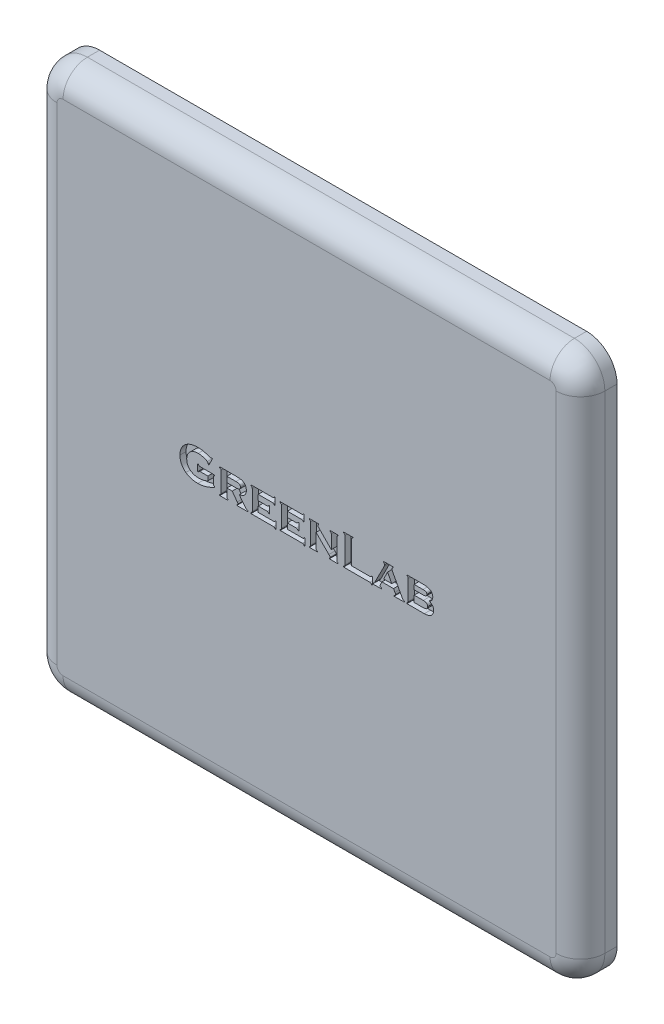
from build123d import *

# Parameters (mm, degrees)
SKETCH1_W           = 45
SKETCH1_H           = 45
BOSS_EXTRUDE1_DEPTH = 3
FILLET1_R           = 2.5
FILLET2_R           = 2
CUT_EXTRUDE1_DEPTH  = 0.5


with BuildPart() as part:
    # Sketch1 → Boss-Extrude1 (new body)
    with BuildSketch(Plane.XY.offset(3)):
        Rectangle(SKETCH1_W, SKETCH1_H)
    extrude(amount=-BOSS_EXTRUDE1_DEPTH)

    # Fillet1
    fillet1_edges = [part.edges().sort_by_distance(p)[0] for p in [
        (-22.5, -22.5, 1.5),
        (-22.5, 22.5, 1.5),
        (22.5, 22.5, 1.5),
        (22.5, -22.5, 1.5),
    ]]
    fillet(fillet1_edges, radius=FILLET1_R)

    # Fillet2
    fillet2_edges = [part.edges().sort_by_distance(p)[0] for p in [
        (0, 22.5, 3),
        (0, -22.5, 3),
        (22.5, 0, 3),
        (-22.5, 0, 3),
        (21.767766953, -21.767766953, 3),
        (-21.767766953, -21.767766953, 3),
        (21.767766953, 21.767766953, 3),
        (-21.767766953, 21.767766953, 3),
    ]]
    fillet(fillet2_edges, radius=FILLET2_R)

    # Sketch2 → Cut-Extrude1 (cut)
    # profile 1 of 8: a face of its own
    with BuildSketch(Plane.XY.offset(3)):
        with BuildLine():
            Line((-8.107638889, -0.347222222), (-8.736979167, -0.347222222))
            add(Edge.make_bspline(
                [(-8.736979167, -0.347222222), (-8.746019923, -0.347634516), (-8.763102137, -0.34841353), (-8.787347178, -0.35149615), (-8.807491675, -0.359463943), (-8.824959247, -0.369292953), (-8.838890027, -0.38393915), (-8.851469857, -0.402230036), (-8.862777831, -0.425071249), (-8.86849343, -0.442262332), (-8.871527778, -0.451388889)],
                knots=[0, 0, 0, 0, 1.161951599, 2.195469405, 3.113157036, 3.92473158, 4.744880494, 5.677977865, 6.767264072, 8, 8, 8, 8], degree=3))
            Line((-8.871527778, -0.451388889), (-8.940972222, -0.451388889))
            Line((-8.940972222, -0.451388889), (-8.940972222, 0.104166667))
            Line((-8.940972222, 0.104166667), (-8.871527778, 0.104166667))
            add(Edge.make_bspline(
                [(-8.871527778, 0.104166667), (-8.868544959, 0.094831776), (-8.86297233, 0.077391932), (-8.851170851, 0.054602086), (-8.83964868, 0.03555398), (-8.825666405, 0.021148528), (-8.808569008, 0.011661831), (-8.788872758, 0.00441836), (-8.765290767, 0.001141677), (-8.74855745, 0.000395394), (-8.73969184, 0)],
                knots=[0, 0, 0, 0, 1.267174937, 2.367390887, 3.316236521, 4.144614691, 4.932227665, 5.829021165, 6.8497767, 8, 8, 8, 8], degree=3))
            Line((-8.73969184, 0), (-7.552083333, 0))
            Line((-7.552083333, 0), (-7.552083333, -0.069444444))
            add(Edge.make_bspline(
                [(-7.552083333, -0.069444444), (-7.561041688, -0.072276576), (-7.577879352, -0.077599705), (-7.600257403, -0.088767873), (-7.618962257, -0.100221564), (-7.633298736, -0.113946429), (-7.644193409, -0.129700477), (-7.650911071, -0.14859326), (-7.655417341, -0.170325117), (-7.655959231, -0.185880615), (-7.65625, -0.194227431)],
                knots=[0, 0, 0, 0, 1.261989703, 2.371971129, 3.357346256, 4.200586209, 5.023932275, 5.909634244, 6.878345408, 8, 8, 8, 8], degree=3))
            Line((-7.65625, -0.194227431), (-7.65625, -0.673828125))
            add(Edge.make_bspline(
                [(-7.65625, -0.673828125), (-7.655889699, -0.682161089), (-7.655219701, -0.697656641), (-7.651544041, -0.719691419), (-7.644732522, -0.738581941), (-7.634437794, -0.754788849), (-7.620144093, -0.76839035), (-7.601054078, -0.779314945), (-7.578418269, -0.790471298), (-7.561224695, -0.795785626), (-7.552083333, -0.798611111)],
                knots=[0, 0, 0, 0, 1.116533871, 2.076248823, 2.980572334, 3.786808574, 4.626198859, 5.59413096, 6.720864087, 8, 8, 8, 8], degree=3))
            Line((-7.552083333, -0.798611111), (-7.552083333, -0.868055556))
            add(Edge.make_bspline(
                [(-7.552083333, -0.868055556), (-7.610666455, -0.901306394), (-7.725820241, -0.966665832), (-7.902088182, -1.051148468), (-8.0768336, -1.123083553), (-8.250217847, -1.181933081), (-8.422179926, -1.22792273), (-8.592791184, -1.26040836), (-8.762157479, -1.280912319), (-8.874726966, -1.283457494), (-8.930664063, -1.284722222)],
                knots=[0, 0, 0, 0, 1.109239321, 2.180373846, 3.216973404, 4.220153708, 5.194106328, 6.146335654, 7.078892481, 8, 8, 8, 8], degree=3))
            add(Edge.make_bspline(
                [(-8.930664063, -1.284722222), (-8.980070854, -1.283992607), (-9.076548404, -1.282567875), (-9.217712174, -1.26841923), (-9.352032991, -1.246781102), (-9.479198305, -1.214926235), (-9.600077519, -1.175751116), (-9.713379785, -1.12610841), (-9.820263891, -1.068197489), (-9.885929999, -1.022231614), (-9.918619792, -0.999348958)],
                knots=[0, 0, 0, 0, 1.133031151, 2.212490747, 3.251195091, 4.25132316, 5.216867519, 6.162529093, 7.085273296, 8, 8, 8, 8], degree=3))
            add(Edge.make_bspline(
                [(-9.918619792, -0.999348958), (-9.938124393, -0.984168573), (-9.976843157, -0.954033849), (-10.031627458, -0.905928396), (-10.082161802, -0.855026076), (-10.129550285, -0.802718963), (-10.17259339, -0.747401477), (-10.211973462, -0.690094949), (-10.248171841, -0.630940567), (-10.279424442, -0.569179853), (-10.30797848, -0.505624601), (-10.332178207, -0.439559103), (-10.352729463, -0.371389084), (-10.370474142, -0.301271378), (-10.383184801, -0.228693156), (-10.392260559, -0.153891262), (-10.398679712, -0.077151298), (-10.399095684, -0.025150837), (-10.399305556, 0.001085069)],
                knots=[0, 0, 0, 0, 1.027594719, 2.039887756, 3.02889878, 4.008719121, 4.97294883, 5.940778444, 6.898978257, 7.854104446, 8.816896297, 9.794723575, 10.777166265, 11.776613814, 12.800294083, 13.838400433, 14.909403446, 16, 16, 16, 16], degree=3))
            add(Edge.make_bspline(
                [(-10.399305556, 0.001085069), (-10.398163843, 0.049624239), (-10.395933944, 0.144426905), (-10.375311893, 0.2828534), (-10.341722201, 0.41361329), (-10.295190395, 0.537141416), (-10.234124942, 0.652470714), (-10.160674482, 0.760529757), (-10.073195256, 0.860943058), (-10.005960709, 0.919974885), (-9.971788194, 0.949978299)],
                knots=[0, 0, 0, 0, 1.080618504, 2.110574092, 3.109061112, 4.08310081, 5.043468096, 6.008781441, 6.987946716, 8, 8, 8, 8], degree=3))
            add(Edge.make_bspline(
                [(-9.971788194, 0.949978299), (-9.937269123, 0.977010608), (-9.867919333, 1.031319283), (-9.752786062, 1.098570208), (-9.630135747, 1.156516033), (-9.498958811, 1.203687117), (-9.359427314, 1.239848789), (-9.211752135, 1.265688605), (-9.055798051, 1.281667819), (-8.948968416, 1.28368846), (-8.894314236, 1.284722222)],
                knots=[0, 0, 0, 0, 0.913103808, 1.834451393, 2.772129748, 3.738097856, 4.735733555, 5.773315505, 6.860825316, 8, 8, 8, 8], degree=3))
            add(Edge.make_bspline(
                [(-8.894314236, 1.284722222), (-8.859221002, 1.284112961), (-8.790049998, 1.282912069), (-8.687866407, 1.276048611), (-8.588838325, 1.263397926), (-8.491005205, 1.245834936), (-8.391504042, 1.221898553), (-8.286896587, 1.191809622), (-8.175981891, 1.154967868), (-8.100485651, 1.126398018), (-8.061523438, 1.111653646)],
                knots=[0, 0, 0, 0, 0.983904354, 1.939338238, 2.869415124, 3.781350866, 4.72455948, 5.737149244, 6.832184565, 8, 8, 8, 8], degree=3))
            add(Edge.make_bspline(
                [(-8.061523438, 1.111653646), (-8.042421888, 1.104222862), (-8.007378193, 1.090590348), (-7.958763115, 1.074748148), (-7.918882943, 1.064487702), (-7.895004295, 1.062571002), (-7.884657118, 1.061740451)],
                knots=[0, 0, 0, 0, 1.33242011, 2.444457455, 3.325947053, 4, 4, 4, 4], degree=3))
            add(Edge.make_bspline(
                [(-7.884657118, 1.061740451), (-7.87789614, 1.062329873), (-7.863399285, 1.063593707), (-7.841685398, 1.072586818), (-7.818394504, 1.085933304), (-7.803311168, 1.097688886), (-7.795138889, 1.10405816)],
                knots=[0, 0, 0, 0, 0.80452628, 1.72506123, 2.767418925, 4, 4, 4, 4], degree=3))
            Line((-7.795138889, 1.10405816), (-7.725694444, 1.076388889))
            Line((-7.725694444, 1.076388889), (-8.020833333, 0.477430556))
            Line((-8.020833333, 0.477430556), (-8.074001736, 0.505642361))
            add(Edge.make_bspline(
                [(-8.074001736, 0.505642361), (-8.074303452, 0.515250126), (-8.074858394, 0.53292155), (-8.079026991, 0.557160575), (-8.083484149, 0.577292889), (-8.090167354, 0.594498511), (-8.101350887, 0.609467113), (-8.115250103, 0.625852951), (-8.134663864, 0.64292875), (-8.149183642, 0.654545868), (-8.157009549, 0.660807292)],
                knots=[0, 0, 0, 0, 1.244331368, 2.288680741, 3.181265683, 3.916936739, 4.658188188, 5.588746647, 6.700376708, 8, 8, 8, 8], degree=3))
            add(Edge.make_bspline(
                [(-8.157009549, 0.660807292), (-8.177704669, 0.675012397), (-8.221692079, 0.705205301), (-8.298225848, 0.743529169), (-8.387995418, 0.777376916), (-8.487614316, 0.808613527), (-8.592124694, 0.834707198), (-8.696489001, 0.853755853), (-8.79800503, 0.865740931), (-8.864805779, 0.867293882), (-8.897569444, 0.868055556)],
                knots=[0, 0, 0, 0, 0.772448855, 1.64183753, 2.627606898, 3.725128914, 4.855858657, 5.942928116, 6.991070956, 8, 8, 8, 8], degree=3))
            add(Edge.make_bspline(
                [(-8.897569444, 0.868055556), (-8.929789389, 0.867506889), (-8.992775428, 0.866434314), (-9.085311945, 0.855766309), (-9.173499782, 0.838592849), (-9.257798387, 0.814661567), (-9.337574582, 0.783836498), (-9.413144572, 0.7458094), (-9.485140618, 0.701918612), (-9.528900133, 0.666554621), (-9.55078125, 0.648871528)],
                knots=[0, 0, 0, 0, 1.098368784, 2.14717621, 3.171603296, 4.15934231, 5.131674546, 6.083189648, 7.041535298, 8, 8, 8, 8], degree=3))
            add(Edge.make_bspline(
                [(-9.55078125, 0.648871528), (-9.574285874, 0.62788857), (-9.620495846, 0.58663618), (-9.679919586, 0.516055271), (-9.730560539, 0.441157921), (-9.772321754, 0.361166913), (-9.804401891, 0.276060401), (-9.82687576, 0.185921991), (-9.841700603, 0.09109294), (-9.843057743, 0.026099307), (-9.84375, -0.007052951)],
                knots=[0, 0, 0, 0, 1.016795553, 1.999014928, 2.971244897, 3.932867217, 4.907271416, 5.901990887, 6.92983762, 8, 8, 8, 8], degree=3))
            add(Edge.make_bspline(
                [(-9.84375, -0.007052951), (-9.843027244, -0.039300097), (-9.84161552, -0.102286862), (-9.827287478, -0.194381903), (-9.805662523, -0.281931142), (-9.773562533, -0.364534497), (-9.733608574, -0.442507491), (-9.683783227, -0.515299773), (-9.62613185, -0.584302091), (-9.580802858, -0.624636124), (-9.557834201, -0.645073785)],
                knots=[0, 0, 0, 0, 1.069643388, 2.089281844, 3.086639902, 4.057689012, 5.02427436, 5.988321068, 6.980662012, 8, 8, 8, 8], degree=3))
            add(Edge.make_bspline(
                [(-9.557834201, -0.645073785), (-9.535565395, -0.66289434), (-9.490831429, -0.698692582), (-9.417196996, -0.744305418), (-9.338000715, -0.782097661), (-9.254216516, -0.813760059), (-9.16521899, -0.838245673), (-9.070966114, -0.855186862), (-8.971633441, -0.866595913), (-8.903570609, -0.867562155), (-8.868815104, -0.868055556)],
                knots=[0, 0, 0, 0, 0.924808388, 1.857771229, 2.80254234, 3.768129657, 4.760342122, 5.792672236, 6.872853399, 8, 8, 8, 8], degree=3))
            add(Edge.make_bspline(
                [(-8.868815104, -0.868055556), (-8.834259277, -0.867328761), (-8.765223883, -0.865876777), (-8.661897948, -0.857261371), (-8.559468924, -0.841751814), (-8.458511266, -0.821473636), (-8.361401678, -0.795732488), (-8.269900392, -0.765568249), (-8.185549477, -0.730503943), (-8.133135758, -0.702960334), (-8.107638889, -0.689561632)],
                knots=[0, 0, 0, 0, 1.05048524, 2.098652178, 3.148964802, 4.19795309, 5.227341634, 6.200829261, 7.124785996, 8, 8, 8, 8], degree=3))
            Line((-8.107638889, -0.689561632), (-8.107638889, -0.347222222))
        make_face()
    # profile 2 of 8: a face of its own
    with BuildSketch(Plane.XY.offset(3)):
        with BuildLine():
            Line((-6.545138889, -0.416666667), (-6.545138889, -1.048177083))
            add(Edge.make_bspline(
                [(-6.545138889, -1.048177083), (-6.544839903, -1.0568801), (-6.544281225, -1.073142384), (-6.539846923, -1.095995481), (-6.532938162, -1.115684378), (-6.523033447, -1.132897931), (-6.508225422, -1.146977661), (-6.489947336, -1.159747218), (-6.467080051, -1.171315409), (-6.450096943, -1.177326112), (-6.440972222, -1.180555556)],
                knots=[0, 0, 0, 0, 1.132768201, 2.116668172, 3.018181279, 3.842213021, 4.674950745, 5.655178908, 6.740169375, 8, 8, 8, 8], degree=3))
            Line((-6.440972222, -1.180555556), (-6.440972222, -1.25))
            Line((-6.440972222, -1.25), (-7.135416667, -1.25))
            Line((-7.135416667, -1.25), (-7.135416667, -1.180555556))
            add(Edge.make_bspline(
                [(-7.135416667, -1.180555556), (-7.126472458, -1.177700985), (-7.109661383, -1.172335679), (-7.087153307, -1.161465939), (-7.068820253, -1.149034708), (-7.05447955, -1.134320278), (-7.043995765, -1.116821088), (-7.036416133, -1.09662627), (-7.032154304, -1.073126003), (-7.031564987, -1.056513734), (-7.03125, -1.047634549)],
                knots=[0, 0, 0, 0, 1.214843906, 2.283358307, 3.225537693, 4.070394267, 4.922042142, 5.848661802, 6.850119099, 8, 8, 8, 8], degree=3))
            Line((-7.03125, -1.047634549), (-7.03125, 0.59624566))
            add(Edge.make_bspline(
                [(-7.03125, 0.59624566), (-7.031680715, 0.604919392), (-7.032501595, 0.621450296), (-7.035379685, 0.64488467), (-7.04376477, 0.664293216), (-7.05327372, 0.681553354), (-7.068135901, 0.6953932), (-7.086043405, 0.708696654), (-7.109231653, 0.719741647), (-7.126318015, 0.725891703), (-7.135416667, 0.729166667)],
                knots=[0, 0, 0, 0, 1.128472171, 2.1507081, 3.035212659, 3.856119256, 4.685698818, 5.643135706, 6.74494729, 8, 8, 8, 8], degree=3))
            Line((-7.135416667, 0.729166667), (-7.135416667, 0.798611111))
            Line((-7.135416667, 0.798611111), (-5.805121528, 0.798611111))
            add(Edge.make_bspline(
                [(-5.805121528, 0.798611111), (-5.764428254, 0.798319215), (-5.688252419, 0.797772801), (-5.581604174, 0.793316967), (-5.490562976, 0.784663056), (-5.41265521, 0.773630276), (-5.344214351, 0.757407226), (-5.281290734, 0.736400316), (-5.221930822, 0.7097724), (-5.185338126, 0.687594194), (-5.167100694, 0.676540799)],
                knots=[0, 0, 0, 0, 1.48188809, 2.77402262, 3.885406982, 4.811191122, 5.637019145, 6.442966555, 7.223990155, 8, 8, 8, 8], degree=3))
            add(Edge.make_bspline(
                [(-5.167100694, 0.676540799), (-5.149512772, 0.664205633), (-5.114727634, 0.639809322), (-5.069915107, 0.594520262), (-5.032309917, 0.543526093), (-5.001059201, 0.487256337), (-4.977218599, 0.425103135), (-4.959891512, 0.357414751), (-4.949527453, 0.283885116), (-4.948464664, 0.232962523), (-4.947916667, 0.206705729)],
                knots=[0, 0, 0, 0, 0.949876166, 1.878651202, 2.806113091, 3.748939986, 4.72015234, 5.745812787, 6.837692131, 8, 8, 8, 8], degree=3))
            add(Edge.make_bspline(
                [(-4.947916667, 0.206705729), (-4.948315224, 0.186614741), (-4.949093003, 0.147407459), (-4.955673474, 0.090219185), (-4.966568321, 0.036559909), (-4.98090752, -0.014020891), (-5.000835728, -0.060657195), (-5.023983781, -0.104677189), (-5.052390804, -0.144664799), (-5.084833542, -0.181705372), (-5.122234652, -0.215345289), (-5.164203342, -0.247287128), (-5.212018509, -0.27549296), (-5.264713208, -0.301929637), (-5.322723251, -0.325390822), (-5.38582309, -0.347290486), (-5.454399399, -0.366137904), (-5.502153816, -0.376563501), (-5.526801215, -0.381944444)],
                knots=[0, 0, 0, 0, 1.054974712, 2.05876829, 3.018077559, 3.928757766, 4.81427522, 5.67693176, 6.535972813, 7.383915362, 8.257948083, 9.17356801, 10.149288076, 11.168732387, 12.267602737, 13.433048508, 14.67512408, 16, 16, 16, 16], degree=3))
            Line((-5.526801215, -0.381944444), (-5.129665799, -0.917426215))
            add(Edge.make_bspline(
                [(-5.129665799, -0.917426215), (-5.112699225, -0.939841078), (-5.081321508, -0.981294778), (-5.035022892, -1.036046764), (-4.995152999, -1.08021234), (-4.958813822, -1.113682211), (-4.92381081, -1.139052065), (-4.887236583, -1.157179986), (-4.849391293, -1.172659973), (-4.82253571, -1.177913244), (-4.809027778, -1.180555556)],
                knots=[0, 0, 0, 0, 1.583031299, 2.927633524, 4.037651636, 4.931799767, 5.706188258, 6.462410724, 7.226616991, 8, 8, 8, 8], degree=3))
            Line((-4.809027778, -1.180555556), (-4.809027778, -1.25))
            Line((-4.809027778, -1.25), (-5.734049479, -1.25))
            Line((-5.734049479, -1.25), (-5.734049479, -1.180555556))
            add(Edge.make_bspline(
                [(-5.734049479, -1.180555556), (-5.719265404, -1.17654565), (-5.69281664, -1.169371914), (-5.661254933, -1.150741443), (-5.63815299, -1.128847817), (-5.63586342, -1.110258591), (-5.634765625, -1.101345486)],
                knots=[0, 0, 0, 0, 1.339679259, 2.396691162, 3.231250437, 4, 4, 4, 4], degree=3))
            add(Edge.make_bspline(
                [(-5.634765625, -1.101345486), (-5.635664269, -1.093828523), (-5.637743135, -1.076439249), (-5.65144713, -1.049381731), (-5.670939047, -1.017140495), (-5.688186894, -0.995183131), (-5.697699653, -0.983072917)],
                knots=[0, 0, 0, 0, 0.664601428, 1.537447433, 2.641820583, 4, 4, 4, 4], degree=3))
            Line((-5.697699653, -0.983072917), (-6.106228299, -0.416666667))
            Line((-6.106228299, -0.416666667), (-6.545138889, -0.416666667))
        make_face()
        with BuildLine():
            Line((-6.545138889, -0.034722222), (-5.799696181, -0.034722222))
            add(Edge.make_bspline(
                [(-5.799696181, -0.034722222), (-5.773260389, -0.03447032), (-5.723897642, -0.033999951), (-5.65548393, -0.026461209), (-5.597284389, -0.017240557), (-5.563741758, -0.004639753), (-5.548502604, 0.001085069)],
                knots=[0, 0, 0, 0, 1.241949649, 2.3190547, 3.236309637, 4, 4, 4, 4], degree=3))
            add(Edge.make_bspline(
                [(-5.548502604, 0.001085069), (-5.539491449, 0.005346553), (-5.521891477, 0.013669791), (-5.498474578, 0.030318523), (-5.477598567, 0.049152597), (-5.462300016, 0.072530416), (-5.449364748, 0.097897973), (-5.44027173, 0.126259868), (-5.43471992, 0.157659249), (-5.434265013, 0.179554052), (-5.434027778, 0.190972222)],
                knots=[0, 0, 0, 0, 1.008207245, 1.969161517, 2.902631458, 3.838078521, 4.780680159, 5.783374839, 6.844026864, 8, 8, 8, 8], degree=3))
            add(Edge.make_bspline(
                [(-5.434027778, 0.190972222), (-5.434749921, 0.210628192), (-5.436100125, 0.247379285), (-5.451519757, 0.297767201), (-5.476937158, 0.339090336), (-5.507998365, 0.363978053), (-5.536935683, 0.379536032), (-5.563166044, 0.389166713), (-5.592860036, 0.397832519), (-5.626793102, 0.404791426), (-5.664490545, 0.410086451), (-5.706152, 0.413651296), (-5.751547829, 0.416703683), (-5.783233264, 0.416679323), (-5.799696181, 0.416666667)],
                knots=[0, 0, 0, 0, 1.425592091, 2.665453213, 3.789359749, 4.900959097, 5.513024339, 6.175067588, 6.928547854, 7.761851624, 8.692003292, 9.695964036, 10.802883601, 12, 12, 12, 12], degree=3))
            Line((-5.799696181, 0.416666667), (-6.545138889, 0.416666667))
            Line((-6.545138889, 0.416666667), (-6.545138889, -0.034722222))
        make_face(mode=Mode.SUBTRACT)
    # profile 3 of 8: a face of its own
    with BuildSketch(Plane.XY.offset(3)):
        with BuildLine():
            Line((-3.975694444, -0.416666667), (-3.975694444, -0.868055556))
            Line((-3.975694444, -0.868055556), (-2.717556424, -0.868055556))
            add(Edge.make_bspline(
                [(-2.717556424, -0.868055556), (-2.708863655, -0.867687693), (-2.692653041, -0.867001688), (-2.669706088, -0.863422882), (-2.650103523, -0.856551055), (-2.633319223, -0.846130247), (-2.618700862, -0.832059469), (-2.606449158, -0.813190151), (-2.59565496, -0.790085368), (-2.589883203, -0.772999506), (-2.586805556, -0.763888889)],
                knots=[0, 0, 0, 0, 1.135380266, 2.11730133, 3.020893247, 3.826673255, 4.678188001, 5.647254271, 6.745456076, 8, 8, 8, 8], degree=3))
            Line((-2.586805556, -0.763888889), (-2.517361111, -0.763888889))
            Line((-2.517361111, -0.763888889), (-2.517361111, -1.354166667))
            Line((-2.517361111, -1.354166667), (-2.586805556, -1.354166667))
            add(Edge.make_bspline(
                [(-2.586805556, -1.354166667), (-2.589434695, -1.345206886), (-2.594390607, -1.328317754), (-2.605383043, -1.305919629), (-2.617763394, -1.287544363), (-2.632437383, -1.273417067), (-2.649532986, -1.262584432), (-2.669669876, -1.255198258), (-2.69296558, -1.250928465), (-2.709399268, -1.25032138), (-2.718098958, -1.25)],
                knots=[0, 0, 0, 0, 1.215074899, 2.290408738, 3.23860127, 4.08884986, 4.925925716, 5.858459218, 6.866307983, 8, 8, 8, 8], degree=3))
            Line((-2.718098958, -1.25), (-4.565972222, -1.25))
            Line((-4.565972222, -1.25), (-4.565972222, -1.180555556))
            add(Edge.make_bspline(
                [(-4.565972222, -1.180555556), (-4.557028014, -1.177700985), (-4.540216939, -1.172335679), (-4.517708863, -1.161465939), (-4.499375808, -1.149034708), (-4.485035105, -1.134320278), (-4.474551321, -1.116821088), (-4.466971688, -1.09662627), (-4.46270986, -1.073126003), (-4.462120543, -1.056513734), (-4.461805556, -1.047634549)],
                knots=[0, 0, 0, 0, 1.214843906, 2.283358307, 3.225537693, 4.070394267, 4.922042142, 5.848661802, 6.850119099, 8, 8, 8, 8], degree=3))
            Line((-4.461805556, -1.047634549), (-4.461805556, 0.59624566))
            add(Edge.make_bspline(
                [(-4.461805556, 0.59624566), (-4.46223627, 0.604919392), (-4.463057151, 0.621450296), (-4.46593524, 0.64488467), (-4.474320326, 0.664293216), (-4.483829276, 0.681553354), (-4.498691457, 0.6953932), (-4.516598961, 0.708696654), (-4.539787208, 0.719741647), (-4.556873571, 0.725891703), (-4.565972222, 0.729166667)],
                knots=[0, 0, 0, 0, 1.128472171, 2.1507081, 3.035212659, 3.856119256, 4.685698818, 5.643135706, 6.74494729, 8, 8, 8, 8], degree=3))
            Line((-4.565972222, 0.729166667), (-4.565972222, 0.798611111))
            Line((-4.565972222, 0.798611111), (-2.788085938, 0.798611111))
            add(Edge.make_bspline(
                [(-2.788085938, 0.798611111), (-2.779203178, 0.798915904), (-2.762584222, 0.799486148), (-2.739357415, 0.803830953), (-2.719458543, 0.810782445), (-2.702290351, 0.82090019), (-2.687598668, 0.835164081), (-2.675521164, 0.853912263), (-2.664328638, 0.87660099), (-2.659070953, 0.893637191), (-2.65625, 0.902777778)],
                knots=[0, 0, 0, 0, 1.152879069, 2.156947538, 3.05581166, 3.877422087, 4.724481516, 5.688477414, 6.75977783, 8, 8, 8, 8], degree=3))
            Line((-2.65625, 0.902777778), (-2.586805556, 0.902777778))
            Line((-2.586805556, 0.902777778), (-2.586805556, 0.3125))
            Line((-2.586805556, 0.3125), (-2.65625, 0.3125))
            add(Edge.make_bspline(
                [(-2.65625, 0.3125), (-2.659115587, 0.321616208), (-2.664505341, 0.338762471), (-2.675190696, 0.361749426), (-2.687799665, 0.380142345), (-2.702246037, 0.394458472), (-2.719460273, 0.404186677), (-2.738915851, 0.412525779), (-2.762335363, 0.415418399), (-2.7788685, 0.416237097), (-2.787543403, 0.416666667)],
                knots=[0, 0, 0, 0, 1.242738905, 2.33741155, 3.283964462, 4.132742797, 4.956020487, 5.843079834, 6.86826837, 8, 8, 8, 8], degree=3))
            Line((-2.787543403, 0.416666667), (-3.975694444, 0.416666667))
            Line((-3.975694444, 0.416666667), (-3.975694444, -0.034722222))
            Line((-3.975694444, -0.034722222), (-3.238389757, -0.034722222))
            add(Edge.make_bspline(
                [(-3.238389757, -0.034722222), (-3.229868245, -0.034409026), (-3.213788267, -0.03381803), (-3.191283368, -0.029499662), (-3.1718834, -0.022577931), (-3.155244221, -0.012251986), (-3.140581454, 0.001797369), (-3.128587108, 0.020705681), (-3.116820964, 0.043291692), (-3.110848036, 0.060304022), (-3.107638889, 0.069444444)],
                knots=[0, 0, 0, 0, 1.117968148, 2.109590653, 2.995889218, 3.806125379, 4.662349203, 5.636774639, 6.730281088, 8, 8, 8, 8], degree=3))
            Line((-3.107638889, 0.069444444), (-3.038194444, 0.069444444))
            Line((-3.038194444, 0.069444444), (-3.038194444, -0.520833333))
            Line((-3.038194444, -0.520833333), (-3.107638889, -0.520833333))
            add(Edge.make_bspline(
                [(-3.107638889, -0.520833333), (-3.110484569, -0.511883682), (-3.115833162, -0.495062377), (-3.126878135, -0.472486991), (-3.138996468, -0.453937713), (-3.153303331, -0.439395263), (-3.170023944, -0.428894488), (-3.189983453, -0.421727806), (-3.213085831, -0.417643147), (-3.229692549, -0.417002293), (-3.238389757, -0.416666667)],
                knots=[0, 0, 0, 0, 1.225527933, 2.303439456, 3.273384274, 4.108798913, 4.947881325, 5.830104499, 6.863590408, 8, 8, 8, 8], degree=3))
            Line((-3.238389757, -0.416666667), (-3.975694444, -0.416666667))
        make_face()
    # profile 4 of 8: a face of its own
    with BuildSketch(Plane.XY.offset(3)):
        with BuildLine():
            Line((-1.579861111, -0.416666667), (-1.579861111, -0.868055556))
            Line((-1.579861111, -0.868055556), (-0.32172309, -0.868055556))
            add(Edge.make_bspline(
                [(-0.32172309, -0.868055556), (-0.313030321, -0.867687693), (-0.296819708, -0.867001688), (-0.273872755, -0.863422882), (-0.25427019, -0.856551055), (-0.23748589, -0.846130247), (-0.222867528, -0.832059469), (-0.210615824, -0.813190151), (-0.199821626, -0.790085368), (-0.19404987, -0.772999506), (-0.190972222, -0.763888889)],
                knots=[0, 0, 0, 0, 1.135380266, 2.11730133, 3.020893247, 3.826673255, 4.678188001, 5.647254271, 6.745456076, 8, 8, 8, 8], degree=3))
            Line((-0.190972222, -0.763888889), (-0.121527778, -0.763888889))
            Line((-0.121527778, -0.763888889), (-0.121527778, -1.354166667))
            Line((-0.121527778, -1.354166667), (-0.190972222, -1.354166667))
            add(Edge.make_bspline(
                [(-0.190972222, -1.354166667), (-0.193601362, -1.345206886), (-0.198557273, -1.328317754), (-0.20954971, -1.305919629), (-0.22193006, -1.287544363), (-0.23660405, -1.273417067), (-0.253699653, -1.262584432), (-0.273836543, -1.255198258), (-0.297132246, -1.250928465), (-0.313565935, -1.25032138), (-0.322265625, -1.25)],
                knots=[0, 0, 0, 0, 1.215074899, 2.290408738, 3.23860127, 4.08884986, 4.925925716, 5.858459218, 6.866307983, 8, 8, 8, 8], degree=3))
            Line((-0.322265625, -1.25), (-2.170138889, -1.25))
            Line((-2.170138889, -1.25), (-2.170138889, -1.180555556))
            add(Edge.make_bspline(
                [(-2.170138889, -1.180555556), (-2.161194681, -1.177700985), (-2.144383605, -1.172335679), (-2.121875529, -1.161465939), (-2.103542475, -1.149034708), (-2.089201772, -1.134320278), (-2.078717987, -1.116821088), (-2.071138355, -1.09662627), (-2.066876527, -1.073126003), (-2.06628721, -1.056513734), (-2.065972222, -1.047634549)],
                knots=[0, 0, 0, 0, 1.214843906, 2.283358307, 3.225537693, 4.070394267, 4.922042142, 5.848661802, 6.850119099, 8, 8, 8, 8], degree=3))
            Line((-2.065972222, -1.047634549), (-2.065972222, 0.59624566))
            add(Edge.make_bspline(
                [(-2.065972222, 0.59624566), (-2.066402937, 0.604919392), (-2.067223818, 0.621450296), (-2.070101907, 0.64488467), (-2.078486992, 0.664293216), (-2.087995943, 0.681553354), (-2.102858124, 0.6953932), (-2.120765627, 0.708696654), (-2.143953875, 0.719741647), (-2.161040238, 0.725891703), (-2.170138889, 0.729166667)],
                knots=[0, 0, 0, 0, 1.128472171, 2.1507081, 3.035212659, 3.856119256, 4.685698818, 5.643135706, 6.74494729, 8, 8, 8, 8], degree=3))
            Line((-2.170138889, 0.729166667), (-2.170138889, 0.798611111))
            Line((-2.170138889, 0.798611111), (-0.392252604, 0.798611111))
            add(Edge.make_bspline(
                [(-0.392252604, 0.798611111), (-0.383369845, 0.798915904), (-0.366750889, 0.799486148), (-0.343524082, 0.803830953), (-0.32362521, 0.810782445), (-0.306457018, 0.82090019), (-0.291765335, 0.835164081), (-0.279687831, 0.853912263), (-0.268495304, 0.87660099), (-0.26323762, 0.893637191), (-0.260416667, 0.902777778)],
                knots=[0, 0, 0, 0, 1.152879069, 2.156947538, 3.05581166, 3.877422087, 4.724481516, 5.688477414, 6.75977783, 8, 8, 8, 8], degree=3))
            Line((-0.260416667, 0.902777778), (-0.190972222, 0.902777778))
            Line((-0.190972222, 0.902777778), (-0.190972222, 0.3125))
            Line((-0.190972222, 0.3125), (-0.260416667, 0.3125))
            add(Edge.make_bspline(
                [(-0.260416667, 0.3125), (-0.263282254, 0.321616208), (-0.268672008, 0.338762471), (-0.279357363, 0.361749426), (-0.291966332, 0.380142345), (-0.306412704, 0.394458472), (-0.323626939, 0.404186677), (-0.343082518, 0.412525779), (-0.36650203, 0.415418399), (-0.383035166, 0.416237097), (-0.391710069, 0.416666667)],
                knots=[0, 0, 0, 0, 1.242738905, 2.33741155, 3.283964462, 4.132742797, 4.956020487, 5.843079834, 6.86826837, 8, 8, 8, 8], degree=3))
            Line((-0.391710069, 0.416666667), (-1.579861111, 0.416666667))
            Line((-1.579861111, 0.416666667), (-1.579861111, -0.034722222))
            Line((-1.579861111, -0.034722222), (-0.842556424, -0.034722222))
            add(Edge.make_bspline(
                [(-0.842556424, -0.034722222), (-0.834034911, -0.034409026), (-0.817954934, -0.03381803), (-0.795450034, -0.029499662), (-0.776050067, -0.022577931), (-0.759410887, -0.012251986), (-0.744748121, 0.001797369), (-0.732753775, 0.020705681), (-0.720987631, 0.043291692), (-0.715014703, 0.060304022), (-0.711805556, 0.069444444)],
                knots=[0, 0, 0, 0, 1.117968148, 2.109590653, 2.995889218, 3.806125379, 4.662349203, 5.636774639, 6.730281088, 8, 8, 8, 8], degree=3))
            Line((-0.711805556, 0.069444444), (-0.642361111, 0.069444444))
            Line((-0.642361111, 0.069444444), (-0.642361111, -0.520833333))
            Line((-0.642361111, -0.520833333), (-0.711805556, -0.520833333))
            add(Edge.make_bspline(
                [(-0.711805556, -0.520833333), (-0.714651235, -0.511883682), (-0.719999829, -0.495062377), (-0.731044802, -0.472486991), (-0.743163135, -0.453937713), (-0.757469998, -0.439395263), (-0.774190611, -0.428894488), (-0.79415012, -0.421727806), (-0.817252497, -0.417643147), (-0.833859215, -0.417002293), (-0.842556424, -0.416666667)],
                knots=[0, 0, 0, 0, 1.225527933, 2.303439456, 3.273384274, 4.108798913, 4.947881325, 5.830104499, 6.863590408, 8, 8, 8, 8], degree=3))
            Line((-0.842556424, -0.416666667), (-1.579861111, -0.416666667))
        make_face()
    # profile 5 of 8: a face of its own
    with BuildSketch(Plane.XY.offset(3)):
        with BuildLine():
            Line((0.78125, 0.093858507), (0.78125, -1.046006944))
            add(Edge.make_bspline(
                [(0.78125, -1.046006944), (0.781544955, -1.054893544), (0.782096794, -1.071519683), (0.786594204, -1.094867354), (0.793319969, -1.115310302), (0.804126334, -1.132883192), (0.818597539, -1.147818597), (0.837278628, -1.160319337), (0.859595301, -1.171849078), (0.876458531, -1.177535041), (0.885416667, -1.180555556)],
                knots=[0, 0, 0, 0, 1.143670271, 2.139718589, 3.053348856, 3.900396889, 4.773630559, 5.710721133, 6.783882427, 8, 8, 8, 8], degree=3))
            Line((0.885416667, -1.180555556), (0.885416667, -1.25))
            Line((0.885416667, -1.25), (0.225694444, -1.25))
            Line((0.225694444, -1.25), (0.225694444, -1.180555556))
            add(Edge.make_bspline(
                [(0.225694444, -1.180555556), (0.234638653, -1.177700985), (0.251449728, -1.172335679), (0.273957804, -1.161465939), (0.292290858, -1.149034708), (0.306631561, -1.134320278), (0.317115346, -1.116821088), (0.324694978, -1.09662627), (0.328956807, -1.073126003), (0.329546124, -1.056513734), (0.329861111, -1.047634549)],
                knots=[0, 0, 0, 0, 1.214843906, 2.283358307, 3.225537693, 4.070394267, 4.922042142, 5.848661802, 6.850119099, 8, 8, 8, 8], degree=3))
            Line((0.329861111, -1.047634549), (0.329861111, 0.59624566))
            add(Edge.make_bspline(
                [(0.329861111, 0.59624566), (0.329430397, 0.604919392), (0.328609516, 0.621450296), (0.325731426, 0.64488467), (0.317346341, 0.664293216), (0.307837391, 0.681553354), (0.29297521, 0.6953932), (0.275067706, 0.708696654), (0.251879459, 0.719741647), (0.234793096, 0.725891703), (0.225694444, 0.729166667)],
                knots=[0, 0, 0, 0, 1.128472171, 2.1507081, 3.035212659, 3.856119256, 4.685698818, 5.643135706, 6.74494729, 8, 8, 8, 8], degree=3))
            Line((0.225694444, 0.729166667), (0.225694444, 0.798611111))
            Line((0.225694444, 0.798611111), (0.996636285, 0.798611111))
            Line((0.996636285, 0.798611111), (0.996636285, 0.729166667))
            add(Edge.make_bspline(
                [(0.996636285, 0.729166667), (0.984845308, 0.725709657), (0.963820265, 0.719545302), (0.937700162, 0.7041957), (0.920119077, 0.683665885), (0.918312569, 0.667239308), (0.917426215, 0.659179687)],
                knots=[0, 0, 0, 0, 1.287745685, 2.296239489, 3.164058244, 4, 4, 4, 4], degree=3))
            add(Edge.make_bspline(
                [(0.917426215, 0.659179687), (0.918315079, 0.651664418), (0.920256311, 0.635251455), (0.93229719, 0.610676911), (0.950467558, 0.584452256), (0.966344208, 0.567813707), (0.974934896, 0.558810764)],
                knots=[0, 0, 0, 0, 0.763994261, 1.668524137, 2.738463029, 4, 4, 4, 4], degree=3))
            Line((0.974934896, 0.558810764), (2.03125, -0.511067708))
            Line((2.03125, -0.511067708), (2.03125, 0.59624566))
            add(Edge.make_bspline(
                [(2.03125, 0.59624566), (2.030829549, 0.604923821), (2.030028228, 0.621463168), (2.026998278, 0.64500946), (2.01890068, 0.664736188), (2.009048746, 0.682110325), (1.994569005, 0.696484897), (1.976542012, 0.709812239), (1.953219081, 0.720234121), (1.936172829, 0.726060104), (1.927083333, 0.729166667)],
                knots=[0, 0, 0, 0, 1.125637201, 2.145305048, 3.049360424, 3.868204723, 4.712412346, 5.667443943, 6.756221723, 8, 8, 8, 8], degree=3))
            Line((1.927083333, 0.729166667), (1.927083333, 0.798611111))
            Line((1.927083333, 0.798611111), (2.586805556, 0.798611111))
            Line((2.586805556, 0.798611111), (2.586805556, 0.729166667))
            add(Edge.make_bspline(
                [(2.586805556, 0.729166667), (2.57769139, 0.72610474), (2.560753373, 0.720414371), (2.537736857, 0.709479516), (2.5193493, 0.696682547), (2.504906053, 0.682071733), (2.494821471, 0.664863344), (2.487774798, 0.644812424), (2.483602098, 0.62155179), (2.482969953, 0.604943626), (2.482638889, 0.59624566)],
                knots=[0, 0, 0, 0, 1.244751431, 2.313280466, 3.288100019, 4.132968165, 4.952453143, 5.848991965, 6.873482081, 8, 8, 8, 8], degree=3))
            Line((2.482638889, 0.59624566), (2.482638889, -1.046006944))
            add(Edge.make_bspline(
                [(2.482638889, -1.046006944), (2.482973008, -1.054703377), (2.483610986, -1.071308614), (2.487744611, -1.094588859), (2.494968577, -1.11472442), (2.504745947, -1.132265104), (2.519189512, -1.147071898), (2.538193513, -1.158984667), (2.560488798, -1.171512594), (2.577635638, -1.17740459), (2.586805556, -1.180555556)],
                knots=[0, 0, 0, 0, 1.1214246, 2.141282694, 3.033768, 3.869628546, 4.710676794, 5.667831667, 6.752785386, 8, 8, 8, 8], degree=3))
            Line((2.586805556, -1.180555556), (2.586805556, -1.25))
            Line((2.586805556, -1.25), (1.868489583, -1.25))
            Line((1.868489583, -1.25), (1.868489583, -1.180555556))
            add(Edge.make_bspline(
                [(1.868489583, -1.180555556), (1.880040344, -1.177588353), (1.900866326, -1.172238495), (1.927214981, -1.158685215), (1.944467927, -1.138616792), (1.946263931, -1.1227832), (1.947157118, -1.114908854)],
                knots=[0, 0, 0, 0, 1.28387963, 2.314830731, 3.161933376, 4, 4, 4, 4], degree=3))
            add(Edge.make_bspline(
                [(1.947157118, -1.114908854), (1.945977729, -1.106177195), (1.943409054, -1.087159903), (1.927434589, -1.0653674), (1.909411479, -1.044070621), (1.888236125, -1.021008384), (1.860370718, -0.991393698), (1.839075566, -0.969993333), (1.827256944, -0.958116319)],
                knots=[0, 0, 0, 0, 0.779058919, 1.696767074, 2.352735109, 3.293916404, 4.498147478, 6, 6, 6, 6], degree=3))
            Line((1.827256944, -0.958116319), (0.78125, 0.093858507))
        make_face()
    # profile 6 of 8: a face of its own
    with BuildSketch(Plane.XY.offset(3)):
        with BuildLine():
            Line((3.697916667, -0.833333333), (5.199110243, -0.833333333))
            add(Edge.make_bspline(
                [(5.199110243, -0.833333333), (5.207807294, -0.833008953), (5.224235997, -0.832396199), (5.247167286, -0.828236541), (5.266753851, -0.820996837), (5.283813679, -0.811225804), (5.29792818, -0.796557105), (5.3101063, -0.778076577), (5.321143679, -0.755239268), (5.326811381, -0.738287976), (5.329861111, -0.729166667)],
                knots=[0, 0, 0, 0, 1.13718709, 2.148142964, 3.030969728, 3.85821599, 4.694202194, 5.66481062, 6.743459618, 8, 8, 8, 8], degree=3))
            Line((5.329861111, -0.729166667), (5.399305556, -0.729166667))
            Line((5.399305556, -0.729166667), (5.399305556, -1.354166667))
            Line((5.399305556, -1.354166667), (5.329861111, -1.354166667))
            add(Edge.make_bspline(
                [(5.329861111, -1.354166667), (5.326766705, -1.345069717), (5.320963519, -1.328009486), (5.31043664, -1.304873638), (5.297733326, -1.286739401), (5.283852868, -1.272040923), (5.266621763, -1.262509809), (5.247204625, -1.254131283), (5.223772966, -1.251251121), (5.207241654, -1.250430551), (5.198567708, -1.25)],
                knots=[0, 0, 0, 0, 1.251925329, 2.347834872, 3.295457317, 4.12837309, 4.952581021, 5.840642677, 6.866989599, 8, 8, 8, 8], degree=3))
            Line((5.198567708, -1.25), (3.038194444, -1.25))
            Line((3.038194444, -1.25), (3.038194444, -1.180555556))
            add(Edge.make_bspline(
                [(3.038194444, -1.180555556), (3.047291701, -1.177461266), (3.064352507, -1.171658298), (3.087484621, -1.161130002), (3.105630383, -1.14843106), (3.120292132, -1.13453667), (3.130125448, -1.117060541), (3.137923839, -1.097248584), (3.141240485, -1.073593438), (3.141970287, -1.057041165), (3.142361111, -1.048177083)],
                knots=[0, 0, 0, 0, 1.245049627, 2.334940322, 3.277358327, 4.105699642, 4.925380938, 5.852235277, 6.849827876, 8, 8, 8, 8], degree=3))
            Line((3.142361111, -1.048177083), (3.142361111, 1.048177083))
            add(Edge.make_bspline(
                [(3.142361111, 1.048177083), (3.141962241, 1.057038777), (3.141217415, 1.073586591), (3.138022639, 1.097102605), (3.130021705, 1.116676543), (3.120138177, 1.134012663), (3.105839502, 1.148459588), (3.087450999, 1.161096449), (3.0643629, 1.17166867), (3.047295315, 1.177464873), (3.038194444, 1.180555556)],
                knots=[0, 0, 0, 0, 1.150912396, 2.149147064, 3.054708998, 3.874917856, 4.720532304, 5.663556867, 6.754149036, 8, 8, 8, 8], degree=3))
            Line((3.038194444, 1.180555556), (3.038194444, 1.25))
            Line((3.038194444, 1.25), (3.802083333, 1.25))
            Line((3.802083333, 1.25), (3.802083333, 1.180555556))
            add(Edge.make_bspline(
                [(3.802083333, 1.180555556), (3.792984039, 1.177656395), (3.776098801, 1.172276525), (3.752882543, 1.162033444), (3.734664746, 1.149116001), (3.719992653, 1.134485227), (3.710255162, 1.11688026), (3.70301995, 1.096763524), (3.698856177, 1.073298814), (3.698241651, 1.056512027), (3.697916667, 1.047634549)],
                knots=[0, 0, 0, 0, 1.233044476, 2.288117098, 3.259808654, 4.10196579, 4.938928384, 5.832590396, 6.853793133, 8, 8, 8, 8], degree=3))
            Line((3.697916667, 1.047634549), (3.697916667, -0.833333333))
        make_face()
    # profile 7 of 8: a face of its own
    with BuildSketch(Plane.XY.offset(3)):
        with BuildLine():
            Line((7.139756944, -0.729166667), (6.189778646, -0.729166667))
            Line((6.189778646, -0.729166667), (6.076388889, -0.94780816))
            add(Edge.make_bspline(
                [(6.076388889, -0.94780816), (6.070577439, -0.960204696), (6.059856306, -0.98307419), (6.047782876, -1.016254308), (6.039301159, -1.045039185), (6.038311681, -1.063324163), (6.037868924, -1.071506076)],
                knots=[0, 0, 0, 0, 1.258043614, 2.320875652, 3.2486483, 4, 4, 4, 4], degree=3))
            add(Edge.make_bspline(
                [(6.037868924, -1.071506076), (6.038350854, -1.078408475), (6.039279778, -1.091712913), (6.044619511, -1.1108393), (6.05490056, -1.127715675), (6.069394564, -1.142105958), (6.086870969, -1.155732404), (6.109203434, -1.165505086), (6.134769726, -1.174324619), (6.153372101, -1.178402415), (6.163194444, -1.180555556)],
                knots=[0, 0, 0, 0, 0.910861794, 1.755694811, 2.589696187, 3.483236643, 4.43677035, 5.49240796, 6.675952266, 8, 8, 8, 8], degree=3))
            Line((6.163194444, -1.180555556), (6.163194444, -1.25))
            Line((6.163194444, -1.25), (5.434027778, -1.25))
            Line((5.434027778, -1.25), (5.434027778, -1.180555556))
            add(Edge.make_bspline(
                [(5.434027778, -1.180555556), (5.444933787, -1.178634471), (5.465760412, -1.174965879), (5.49426339, -1.165954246), (5.518478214, -1.154375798), (5.539311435, -1.139559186), (5.557979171, -1.118869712), (5.577231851, -1.092229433), (5.597843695, -1.058174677), (5.611225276, -1.032706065), (5.618489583, -1.018880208)],
                knots=[0, 0, 0, 0, 1.026027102, 1.959349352, 2.761782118, 3.5064187, 4.313045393, 5.332612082, 6.551985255, 8, 8, 8, 8], degree=3))
            Line((5.618489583, -1.018880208), (6.372612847, 0.467122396))
            add(Edge.make_bspline(
                [(6.372612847, 0.467122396), (6.378969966, 0.4805931), (6.391065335, 0.506223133), (6.405131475, 0.544329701), (6.412936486, 0.580194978), (6.414291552, 0.603268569), (6.414930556, 0.614149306)],
                knots=[0, 0, 0, 0, 1.158371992, 2.203976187, 3.153055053, 4, 4, 4, 4], degree=3))
            add(Edge.make_bspline(
                [(6.414930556, 0.614149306), (6.413638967, 0.625991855), (6.411020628, 0.649999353), (6.389677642, 0.682843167), (6.355350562, 0.709427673), (6.327205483, 0.722198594), (6.311848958, 0.729166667)],
                knots=[0, 0, 0, 0, 0.861054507, 1.745550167, 2.769926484, 4, 4, 4, 4], degree=3))
            Line((6.311848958, 0.729166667), (6.311848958, 0.798611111))
            Line((6.311848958, 0.798611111), (7.109375, 0.798611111))
            Line((7.109375, 0.798611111), (7.109375, 0.729166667))
            add(Edge.make_bspline(
                [(7.109375, 0.729166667), (7.094246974, 0.722546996), (7.066138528, 0.710247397), (7.033348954, 0.68115365), (7.012023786, 0.646161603), (7.009659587, 0.620220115), (7.008463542, 0.607096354)],
                knots=[0, 0, 0, 0, 1.167592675, 2.169431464, 3.073918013, 4, 4, 4, 4], degree=3))
            add(Edge.make_bspline(
                [(7.008463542, 0.607096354), (7.008991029, 0.596548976), (7.010107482, 0.57422494), (7.020079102, 0.539467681), (7.033691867, 0.501062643), (7.047007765, 0.475297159), (7.054036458, 0.461697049)],
                knots=[0, 0, 0, 0, 0.821800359, 1.739380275, 2.806749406, 4, 4, 4, 4], degree=3))
            Line((7.054036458, 0.461697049), (7.826605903, -0.979275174))
            add(Edge.make_bspline(
                [(7.826605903, -0.979275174), (7.836633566, -0.997232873), (7.854932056, -1.030002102), (7.881087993, -1.073693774), (7.904536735, -1.106669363), (7.925317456, -1.131422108), (7.947707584, -1.149353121), (7.973996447, -1.161725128), (8.003973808, -1.173871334), (8.026322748, -1.17823669), (8.038194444, -1.180555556)],
                knots=[0, 0, 0, 0, 1.613020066, 2.94344076, 3.990283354, 4.784068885, 5.470665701, 6.219068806, 7.053974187, 8, 8, 8, 8], degree=3))
            Line((8.038194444, -1.180555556), (8.038194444, -1.25))
            Line((8.038194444, -1.25), (7.1875, -1.25))
            Line((7.1875, -1.25), (7.1875, -1.180555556))
            add(Edge.make_bspline(
                [(7.1875, -1.180555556), (7.196778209, -1.178789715), (7.21432341, -1.17545049), (7.238424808, -1.167295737), (7.258902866, -1.157095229), (7.27554808, -1.144306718), (7.28914655, -1.129502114), (7.298221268, -1.111857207), (7.304003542, -1.092303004), (7.304454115, -1.078602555), (7.3046875, -1.071506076)],
                knots=[0, 0, 0, 0, 1.280586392, 2.42160363, 3.442514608, 4.370371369, 5.257057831, 6.146457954, 7.039913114, 8, 8, 8, 8], degree=3))
            add(Edge.make_bspline(
                [(7.3046875, -1.071506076), (7.304129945, -1.061686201), (7.302933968, -1.040622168), (7.293238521, -1.007691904), (7.278677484, -0.971554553), (7.26552331, -0.947144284), (7.258572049, -0.934244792)],
                knots=[0, 0, 0, 0, 0.804870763, 1.726480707, 2.798569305, 4, 4, 4, 4], degree=3))
            Line((7.258572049, -0.934244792), (7.139756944, -0.729166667))
        make_face()
        Polygon((6.994357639, -0.451388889), (6.655815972, 0.203993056), (6.329210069, -0.451388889), align=None, mode=Mode.SUBTRACT)
    # profile 8 of 8: a face of its own
    with BuildSketch(Plane.XY.offset(3)):
        with BuildLine():
            add(Edge.make_bspline(
                [(10.073784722, -0.149739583), (10.097643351, -0.160989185), (10.142611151, -0.18219199), (10.203527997, -0.216984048), (10.254862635, -0.251276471), (10.283442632, -0.276751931), (10.296766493, -0.288628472)],
                knots=[0, 0, 0, 0, 1.199284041, 2.260363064, 3.188989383, 4, 4, 4, 4], degree=3))
            add(Edge.make_bspline(
                [(10.296766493, -0.288628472), (10.307685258, -0.299797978), (10.329533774, -0.322148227), (10.357737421, -0.359592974), (10.380996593, -0.400283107), (10.400928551, -0.443106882), (10.415332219, -0.489355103), (10.426235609, -0.53813901), (10.432843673, -0.589917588), (10.433627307, -0.625342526), (10.434027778, -0.643446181)],
                knots=[0, 0, 0, 0, 0.957204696, 1.915372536, 2.864513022, 3.827290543, 4.805779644, 5.828215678, 6.89012558, 8, 8, 8, 8], degree=3))
            add(Edge.make_bspline(
                [(10.434027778, -0.643446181), (10.433485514, -0.667720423), (10.432428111, -0.71505464), (10.421763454, -0.784000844), (10.404776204, -0.848795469), (10.379794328, -0.909040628), (10.349147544, -0.965409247), (10.310325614, -1.01679032), (10.265336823, -1.064590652), (10.230422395, -1.091835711), (10.212673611, -1.105685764)],
                knots=[0, 0, 0, 0, 1.09149512, 2.128390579, 3.131133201, 4.098244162, 5.056171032, 6.009871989, 6.988316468, 8, 8, 8, 8], degree=3))
            add(Edge.make_bspline(
                [(10.212673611, -1.105685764), (10.195720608, -1.117273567), (10.161255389, -1.140831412), (10.104398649, -1.169658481), (10.043566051, -1.194938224), (9.97780638, -1.214584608), (9.907843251, -1.231420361), (9.832748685, -1.241377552), (9.753305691, -1.249077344), (9.698733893, -1.249686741), (9.670681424, -1.25)],
                knots=[0, 0, 0, 0, 0.863665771, 1.755820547, 2.677628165, 3.63366667, 4.641991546, 5.703604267, 6.819544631, 8, 8, 8, 8], degree=3))
            Line((9.670681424, -1.25), (8.246527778, -1.25))
            Line((8.246527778, -1.25), (8.246527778, -1.180555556))
            add(Edge.make_bspline(
                [(8.246527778, -1.180555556), (8.255471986, -1.177700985), (8.272283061, -1.172335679), (8.294791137, -1.161465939), (8.313124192, -1.149034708), (8.327464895, -1.134320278), (8.337948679, -1.116821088), (8.345528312, -1.09662627), (8.34979014, -1.073126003), (8.350379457, -1.056513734), (8.350694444, -1.047634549)],
                knots=[0, 0, 0, 0, 1.214843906, 2.283358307, 3.225537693, 4.070394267, 4.922042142, 5.848661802, 6.850119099, 8, 8, 8, 8], degree=3))
            Line((8.350694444, -1.047634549), (8.350694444, 0.59624566))
            add(Edge.make_bspline(
                [(8.350694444, 0.59624566), (8.35026373, 0.604919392), (8.349442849, 0.621450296), (8.34656476, 0.64488467), (8.338179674, 0.664293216), (8.328670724, 0.681553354), (8.313808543, 0.6953932), (8.295901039, 0.708696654), (8.272712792, 0.719741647), (8.255626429, 0.725891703), (8.246527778, 0.729166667)],
                knots=[0, 0, 0, 0, 1.128472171, 2.1507081, 3.035212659, 3.856119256, 4.685698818, 5.643135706, 6.74494729, 8, 8, 8, 8], degree=3))
            Line((8.246527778, 0.729166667), (8.246527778, 0.798611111))
            Line((8.246527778, 0.798611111), (9.644097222, 0.798611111))
            add(Edge.make_bspline(
                [(9.644097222, 0.798611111), (9.673770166, 0.798241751), (9.731022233, 0.797529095), (9.813775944, 0.79076516), (9.890469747, 0.780753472), (9.961193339, 0.766504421), (10.025524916, 0.746774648), (10.083783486, 0.72342829), (10.13685089, 0.69681193), (10.167738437, 0.674084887), (10.182834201, 0.662977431)],
                knots=[0, 0, 0, 0, 1.259531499, 2.430186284, 3.522538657, 4.541950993, 5.489154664, 6.374533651, 7.205580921, 8, 8, 8, 8], degree=3))
            add(Edge.make_bspline(
                [(10.182834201, 0.662977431), (10.197437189, 0.650839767), (10.226134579, 0.626987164), (10.263196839, 0.585830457), (10.294406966, 0.541494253), (10.320010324, 0.493941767), (10.340467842, 0.443075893), (10.354098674, 0.388655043), (10.36332541, 0.33107878), (10.364156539, 0.291560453), (10.364583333, 0.271267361)],
                knots=[0, 0, 0, 0, 1.01613969, 1.996889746, 2.956405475, 3.914354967, 4.883989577, 5.884961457, 6.913904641, 8, 8, 8, 8], degree=3))
            add(Edge.make_bspline(
                [(10.364583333, 0.271267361), (10.364051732, 0.247863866), (10.363033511, 0.203037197), (10.34983918, 0.139231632), (10.330452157, 0.081432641), (10.300432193, 0.029734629), (10.26018638, -0.017403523), (10.209431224, -0.063436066), (10.146154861, -0.107961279), (10.098797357, -0.135300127), (10.073784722, -0.149739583)],
                knots=[0, 0, 0, 0, 1.030855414, 1.974483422, 2.862815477, 3.710022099, 4.593755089, 5.587821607, 6.725968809, 8, 8, 8, 8], degree=3))
        make_face()
        with BuildLine():
            Line((8.836805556, 0.034722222), (9.563802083, 0.034722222))
            add(Edge.make_bspline(
                [(9.563802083, 0.034722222), (9.590416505, 0.035130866), (9.63963178, 0.03588653), (9.707028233, 0.043934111), (9.762426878, 0.055951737), (9.806204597, 0.07504326), (9.839992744, 0.10149828), (9.862622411, 0.136904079), (9.87659936, 0.17946957), (9.877823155, 0.210383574), (9.878472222, 0.226779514)],
                knots=[0, 0, 0, 0, 1.51097798, 2.794094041, 3.850547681, 4.719436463, 5.486328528, 6.249910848, 7.071800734, 8, 8, 8, 8], degree=3))
            add(Edge.make_bspline(
                [(9.878472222, 0.226779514), (9.877784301, 0.242980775), (9.876497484, 0.273286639), (9.863176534, 0.315315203), (9.840488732, 0.349742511), (9.807085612, 0.375948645), (9.763426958, 0.394755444), (9.708042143, 0.407737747), (9.640150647, 0.415410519), (9.590589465, 0.416225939), (9.563802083, 0.416666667)],
                knots=[0, 0, 0, 0, 0.921773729, 1.724257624, 2.482423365, 3.237988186, 4.110479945, 5.17376898, 6.472447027, 8, 8, 8, 8], degree=3))
            Line((9.563802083, 0.416666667), (8.836805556, 0.416666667))
            Line((8.836805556, 0.416666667), (8.836805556, 0.034722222))
        make_face(mode=Mode.SUBTRACT)
        with BuildLine():
            Line((8.836805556, -0.868055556), (9.585503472, -0.868055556))
            add(Edge.make_bspline(
                [(9.585503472, -0.868055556), (9.613935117, -0.867232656), (9.66710476, -0.865693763), (9.741601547, -0.854278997), (9.804700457, -0.833815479), (9.857569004, -0.805781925), (9.898434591, -0.76790871), (9.927598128, -0.721570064), (9.945480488, -0.667132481), (9.947081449, -0.628035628), (9.947916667, -0.607638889)],
                knots=[0, 0, 0, 0, 1.34516632, 2.515577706, 3.551944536, 4.47115753, 5.324827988, 6.155678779, 7.037821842, 8, 8, 8, 8], degree=3))
            add(Edge.make_bspline(
                [(9.947916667, -0.607638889), (9.947138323, -0.587040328), (9.945659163, -0.547894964), (9.927276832, -0.493534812), (9.898832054, -0.44682567), (9.857173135, -0.409689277), (9.805026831, -0.380565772), (9.741379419, -0.361442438), (9.667218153, -0.348623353), (9.613961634, -0.347710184), (9.585503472, -0.347222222)],
                knots=[0, 0, 0, 0, 0.97017498, 1.843713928, 2.681349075, 3.528750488, 4.451635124, 5.484788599, 6.655971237, 8, 8, 8, 8], degree=3))
            Line((9.585503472, -0.347222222), (8.836805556, -0.347222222))
            Line((8.836805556, -0.347222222), (8.836805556, -0.868055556))
        make_face(mode=Mode.SUBTRACT)
    extrude(amount=-CUT_EXTRUDE1_DEPTH, mode=Mode.SUBTRACT)


solid = part.part
